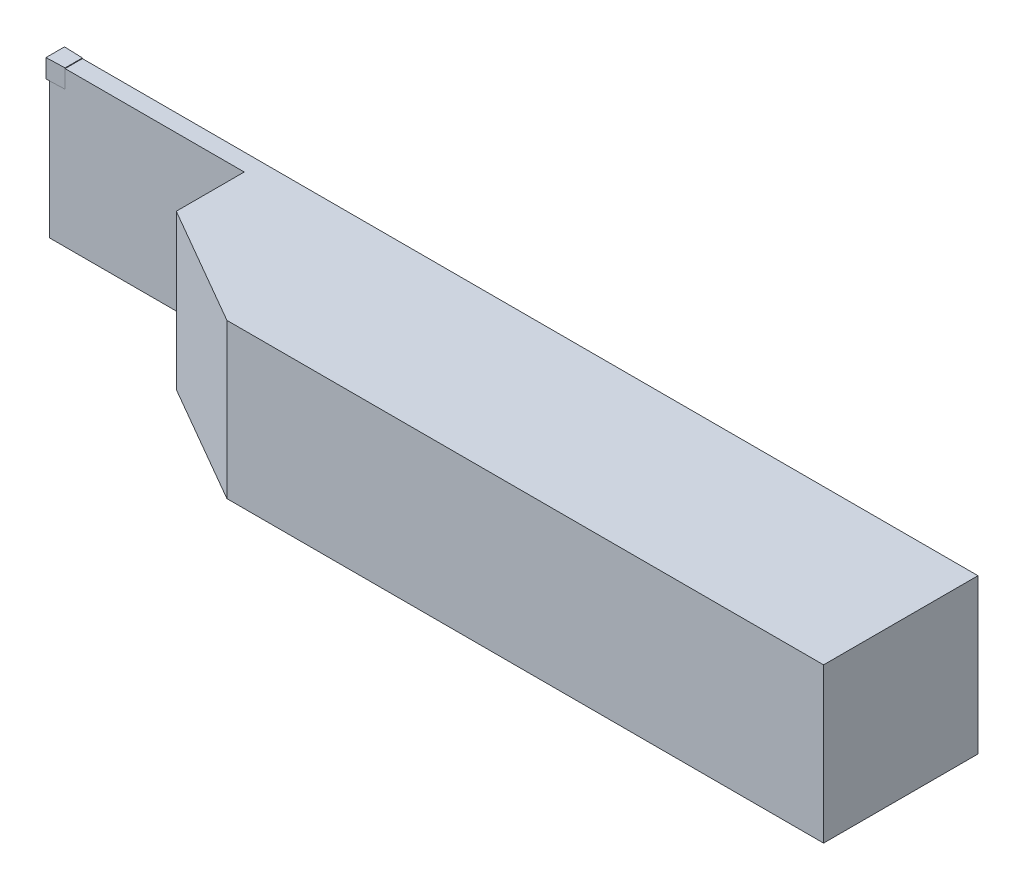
ISO-10303-21;
HEADER;
FILE_DESCRIPTION(('STEP AP214'),'2;1');
FILE_NAME('part.step','',(''),(''),'','','');
FILE_SCHEMA(('AUTOMOTIVE_DESIGN { 1 0 10303 214 1 1 1 1 }'));
ENDSEC;
DATA;
#1=APPLICATION_CONTEXT('core data for automotive mechanical design processes');
#2=APPLICATION_PROTOCOL_DEFINITION('international standard','automotive_design',2000,#1);
#3=PRODUCT_CONTEXT('',#1,'mechanical');
#4=PRODUCT('Part','Part','',(#3));
#5=PRODUCT_RELATED_PRODUCT_CATEGORY('part','',(#4));
#6=PRODUCT_DEFINITION_FORMATION('','',#4);
#7=PRODUCT_DEFINITION_CONTEXT('part definition',#1,'design');
#8=PRODUCT_DEFINITION('design','',#6,#7);
#9=PRODUCT_DEFINITION_SHAPE('','',#8);
#10=(LENGTH_UNIT() NAMED_UNIT(*) SI_UNIT(.MILLI.,.METRE.));
#11=(NAMED_UNIT(*) PLANE_ANGLE_UNIT() SI_UNIT($,.RADIAN.));
#12=(NAMED_UNIT(*) SI_UNIT($,.STERADIAN.) SOLID_ANGLE_UNIT());
#13=UNCERTAINTY_MEASURE_WITH_UNIT(LENGTH_MEASURE(1.E-05),#10,'distance_accuracy_value','');
#14=(GEOMETRIC_REPRESENTATION_CONTEXT(3) GLOBAL_UNCERTAINTY_ASSIGNED_CONTEXT((#13)) GLOBAL_UNIT_ASSIGNED_CONTEXT((#10,
#11,#12)) REPRESENTATION_CONTEXT('',''));
#15=CARTESIAN_POINT('',(0.,0.,0.));
#16=DIRECTION('',(0.,0.,1.));
#17=DIRECTION('',(1.,0.,0.));
#18=AXIS2_PLACEMENT_3D('',#15,#16,#17);
#19=CARTESIAN_POINT('',(0.00999999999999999,-3.,0.0103388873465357));
#20=DIRECTION('',(0.,1.,0.));
#21=DIRECTION('',(0.,0.,1.));
#22=AXIS2_PLACEMENT_3D('',#19,#20,#21);
#23=CYLINDRICAL_SURFACE('',#22,0.01);
#24=CARTESIAN_POINT('',(0.00999999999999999,0.,0.0103388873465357));
#25=DIRECTION('',(0.,1.,0.));
#26=DIRECTION('',(0.,0.,1.));
#27=AXIS2_PLACEMENT_3D('',#24,#25,#26);
#28=CIRCLE('',#27,0.01);
#29=CARTESIAN_POINT('',(0.0103331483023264,0.,0.000344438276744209));
#30=VERTEX_POINT('',#29);
#31=CARTESIAN_POINT('',(0.,0.,0.0103388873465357));
#32=VERTEX_POINT('',#31);
#33=EDGE_CURVE('E139',#30,#32,#28,.T.);
#34=ORIENTED_EDGE('',*,*,#33,.F.);
#35=DIRECTION('',(0.,1.,0.));
#36=VECTOR('',#35,1.);
#37=CARTESIAN_POINT('',(0.0103331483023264,-3.,0.000344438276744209));
#38=LINE('',#37,#36);
#39=CARTESIAN_POINT('',(0.0103331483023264,-3.,0.000344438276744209));
#40=VERTEX_POINT('',#39);
#41=EDGE_CURVE('E53',#40,#30,#38,.T.);
#42=ORIENTED_EDGE('',*,*,#41,.F.);
#43=CARTESIAN_POINT('',(0.00999999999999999,-3.,0.0103388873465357));
#44=DIRECTION('',(0.,1.,0.));
#45=DIRECTION('',(0.,0.,1.));
#46=AXIS2_PLACEMENT_3D('',#43,#44,#45);
#47=CIRCLE('',#46,0.01);
#48=CARTESIAN_POINT('',(0.,-3.,0.0103388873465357));
#49=VERTEX_POINT('',#48);
#50=EDGE_CURVE('E161',#40,#49,#47,.T.);
#51=ORIENTED_EDGE('',*,*,#50,.T.);
#52=DIRECTION('',(0.,1.,0.));
#53=VECTOR('',#52,1.);
#54=CARTESIAN_POINT('',(0.,-3.,0.0103388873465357));
#55=LINE('',#54,#53);
#56=EDGE_CURVE('E92',#49,#32,#55,.T.);
#57=ORIENTED_EDGE('',*,*,#56,.T.);
#58=EDGE_LOOP('',(#34,#42,#51,#57));
#59=FACE_BOUND('',#58,.T.);
#60=ADVANCED_FACE('F30',(#59),#23,.T.);
#61=CARTESIAN_POINT('',(0.0103331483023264,-3.,0.000344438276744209));
#62=DIRECTION('',(0.0333148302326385,0.,-0.999444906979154));
#63=DIRECTION('',(-0.999444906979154,0.,-0.0333148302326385));
#64=AXIS2_PLACEMENT_3D('',#61,#62,#63);
#65=PLANE('',#64);
#66=DIRECTION('',(-0.999444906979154,0.,-0.0333148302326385));
#67=VECTOR('',#66,1.);
#68=CARTESIAN_POINT('',(0.0103331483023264,0.,0.000344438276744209));
#69=LINE('',#68,#67);
#70=CARTESIAN_POINT('',(2.99033314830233,0.,0.0996777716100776));
#71=VERTEX_POINT('',#70);
#72=EDGE_CURVE('E158',#71,#30,#69,.T.);
#73=ORIENTED_EDGE('',*,*,#72,.F.);
#74=DIRECTION('',(0.,1.,0.));
#75=VECTOR('',#74,1.);
#76=CARTESIAN_POINT('',(2.99033314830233,-3.,0.0996777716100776));
#77=LINE('',#76,#75);
#78=CARTESIAN_POINT('',(2.99033314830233,-3.,0.0996777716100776));
#79=VERTEX_POINT('',#78);
#80=EDGE_CURVE('E163',#79,#71,#77,.T.);
#81=ORIENTED_EDGE('',*,*,#80,.F.);
#82=DIRECTION('',(-0.999444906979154,0.,-0.0333148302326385));
#83=VECTOR('',#82,1.);
#84=CARTESIAN_POINT('',(0.0103331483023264,-3.,0.000344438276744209));
#85=LINE('',#84,#83);
#86=EDGE_CURVE('E137',#79,#40,#85,.T.);
#87=ORIENTED_EDGE('',*,*,#86,.T.);
#88=ORIENTED_EDGE('',*,*,#41,.T.);
#89=EDGE_LOOP('',(#73,#81,#87,#88));
#90=FACE_BOUND('',#89,.T.);
#91=ADVANCED_FACE('F215',(#90),#65,.T.);
#92=CARTESIAN_POINT('',(2.99,-3.,0.109672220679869));
#93=DIRECTION('',(0.,1.,0.));
#94=DIRECTION('',(0.,0.,1.));
#95=AXIS2_PLACEMENT_3D('',#92,#93,#94);
#96=CYLINDRICAL_SURFACE('',#95,0.0100000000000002);
#97=DIRECTION('',(0.,1.,0.));
#98=VECTOR('',#97,1.);
#99=CARTESIAN_POINT('',(2.99253932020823,-3.,0.0999999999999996));
#100=LINE('',#99,#98);
#101=CARTESIAN_POINT('',(2.99253932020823,-3.,0.0999999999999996));
#102=VERTEX_POINT('',#101);
#103=CARTESIAN_POINT('',(2.99253932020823,-0.1,0.0999999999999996));
#104=VERTEX_POINT('',#103);
#105=EDGE_CURVE('E189',#102,#104,#100,.T.);
#106=ORIENTED_EDGE('',*,*,#105,.F.);
#107=CARTESIAN_POINT('',(2.99,-3.,0.109672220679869));
#108=DIRECTION('',(0.,1.,0.));
#109=DIRECTION('',(0.,0.,-1.));
#110=AXIS2_PLACEMENT_3D('',#107,#108,#109);
#111=CIRCLE('',#110,0.0100000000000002);
#112=EDGE_CURVE('E127',#102,#79,#111,.T.);
#113=ORIENTED_EDGE('',*,*,#112,.T.);
#114=ORIENTED_EDGE('',*,*,#80,.T.);
#115=CARTESIAN_POINT('',(2.99,0.,0.109672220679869));
#116=DIRECTION('',(0.,1.,0.));
#117=DIRECTION('',(0.,0.,-1.));
#118=AXIS2_PLACEMENT_3D('',#115,#116,#117);
#119=CIRCLE('',#118,0.0100000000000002);
#120=CARTESIAN_POINT('',(3.,0.,0.109672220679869));
#121=VERTEX_POINT('',#120);
#122=EDGE_CURVE('E155',#121,#71,#119,.T.);
#123=ORIENTED_EDGE('',*,*,#122,.F.);
#124=DIRECTION('',(0.,1.,0.));
#125=VECTOR('',#124,1.);
#126=CARTESIAN_POINT('',(3.,-3.,0.109672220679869));
#127=LINE('',#126,#125);
#128=CARTESIAN_POINT('',(3.,-0.0999999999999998,0.109672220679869));
#129=VERTEX_POINT('',#128);
#130=EDGE_CURVE('E165',#129,#121,#127,.T.);
#131=ORIENTED_EDGE('',*,*,#130,.F.);
#132=CARTESIAN_POINT('',(2.99,-0.1,0.109672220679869));
#133=DIRECTION('',(0.,1.,0.));
#134=DIRECTION('',(0.,0.,1.));
#135=AXIS2_PLACEMENT_3D('',#132,#133,#134);
#136=CIRCLE('',#135,0.0100000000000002);
#137=EDGE_CURVE('E143',#104,#129,#136,.F.);
#138=ORIENTED_EDGE('',*,*,#137,.F.);
#139=EDGE_LOOP('',(#106,#113,#114,#123,#131,#138));
#140=FACE_BOUND('',#139,.T.);
#141=ADVANCED_FACE('F198',(#140),#96,.T.);
#142=CARTESIAN_POINT('',(3.,-3.,0.109672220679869));
#143=DIRECTION('',(1.,0.,0.));
#144=DIRECTION('',(0.,0.,-1.));
#145=AXIS2_PLACEMENT_3D('',#142,#143,#144);
#146=PLANE('',#145);
#147=DIRECTION('',(0.,0.,1.));
#148=VECTOR('',#147,1.);
#149=CARTESIAN_POINT('',(3.,-0.0999999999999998,0.109672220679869));
#150=LINE('',#149,#148);
#151=CARTESIAN_POINT('',(3.,-0.1,2.89032777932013));
#152=VERTEX_POINT('',#151);
#153=EDGE_CURVE('E202',#129,#152,#150,.T.);
#154=ORIENTED_EDGE('',*,*,#153,.F.);
#155=ORIENTED_EDGE('',*,*,#130,.T.);
#156=DIRECTION('',(0.,0.,-1.));
#157=VECTOR('',#156,1.);
#158=CARTESIAN_POINT('',(3.,0.,0.109672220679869));
#159=LINE('',#158,#157);
#160=CARTESIAN_POINT('',(3.,0.,2.89032777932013));
#161=VERTEX_POINT('',#160);
#162=EDGE_CURVE('E152',#161,#121,#159,.T.);
#163=ORIENTED_EDGE('',*,*,#162,.F.);
#164=DIRECTION('',(0.,1.,0.));
#165=VECTOR('',#164,1.);
#166=CARTESIAN_POINT('',(3.,-3.,2.89032777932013));
#167=LINE('',#166,#165);
#168=EDGE_CURVE('E115',#152,#161,#167,.T.);
#169=ORIENTED_EDGE('',*,*,#168,.F.);
#170=EDGE_LOOP('',(#154,#155,#163,#169));
#171=FACE_BOUND('',#170,.T.);
#172=ADVANCED_FACE('F220',(#171),#146,.T.);
#173=CARTESIAN_POINT('',(2.99,-3.,2.89032777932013));
#174=DIRECTION('',(0.,1.,0.));
#175=DIRECTION('',(0.,0.,1.));
#176=AXIS2_PLACEMENT_3D('',#173,#174,#175);
#177=CYLINDRICAL_SURFACE('',#176,0.00999999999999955);
#178=DIRECTION('',(0.,1.,0.));
#179=VECTOR('',#178,1.);
#180=CARTESIAN_POINT('',(2.99253932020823,-3.,2.9));
#181=LINE('',#180,#179);
#182=CARTESIAN_POINT('',(2.99253932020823,-0.1,2.9));
#183=VERTEX_POINT('',#182);
#184=CARTESIAN_POINT('',(2.99253932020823,-3.,2.9));
#185=VERTEX_POINT('',#184);
#186=EDGE_CURVE('E44',#183,#185,#181,.F.);
#187=ORIENTED_EDGE('',*,*,#186,.F.);
#188=CARTESIAN_POINT('',(2.99,-0.1,2.89032777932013));
#189=DIRECTION('',(0.,1.,0.));
#190=DIRECTION('',(0.,0.,1.));
#191=AXIS2_PLACEMENT_3D('',#188,#189,#190);
#192=CIRCLE('',#191,0.00999999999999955);
#193=EDGE_CURVE('E11',#152,#183,#192,.F.);
#194=ORIENTED_EDGE('',*,*,#193,.F.);
#195=ORIENTED_EDGE('',*,*,#168,.T.);
#196=CARTESIAN_POINT('',(2.99,0.,2.89032777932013));
#197=DIRECTION('',(0.,1.,0.));
#198=DIRECTION('',(0.,0.,-1.));
#199=AXIS2_PLACEMENT_3D('',#196,#197,#198);
#200=CIRCLE('',#199,0.00999999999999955);
#201=CARTESIAN_POINT('',(2.99033314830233,0.,2.90032222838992));
#202=VERTEX_POINT('',#201);
#203=EDGE_CURVE('E110',#202,#161,#200,.T.);
#204=ORIENTED_EDGE('',*,*,#203,.F.);
#205=DIRECTION('',(0.,1.,0.));
#206=VECTOR('',#205,1.);
#207=CARTESIAN_POINT('',(2.99033314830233,-3.,2.90032222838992));
#208=LINE('',#207,#206);
#209=CARTESIAN_POINT('',(2.99033314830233,-3.,2.90032222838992));
#210=VERTEX_POINT('',#209);
#211=EDGE_CURVE('E105',#210,#202,#208,.T.);
#212=ORIENTED_EDGE('',*,*,#211,.F.);
#213=CARTESIAN_POINT('',(2.99,-3.,2.89032777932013));
#214=DIRECTION('',(0.,1.,0.));
#215=DIRECTION('',(0.,0.,-1.));
#216=AXIS2_PLACEMENT_3D('',#213,#214,#215);
#217=CIRCLE('',#216,0.00999999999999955);
#218=EDGE_CURVE('E108',#210,#185,#217,.T.);
#219=ORIENTED_EDGE('',*,*,#218,.T.);
#220=EDGE_LOOP('',(#187,#194,#195,#204,#212,#219));
#221=FACE_BOUND('',#220,.T.);
#222=ADVANCED_FACE('F107',(#221),#177,.T.);
#223=CARTESIAN_POINT('',(2.99033314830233,-3.,2.90032222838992));
#224=DIRECTION('',(0.0333148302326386,0.,0.999444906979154));
#225=DIRECTION('',(0.999444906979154,0.,-0.0333148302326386));
#226=AXIS2_PLACEMENT_3D('',#223,#224,#225);
#227=PLANE('',#226);
#228=DIRECTION('',(0.999444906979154,0.,-0.0333148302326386));
#229=VECTOR('',#228,1.);
#230=CARTESIAN_POINT('',(2.99033314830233,0.,2.90032222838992));
#231=LINE('',#230,#229);
#232=CARTESIAN_POINT('',(0.0103331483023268,0.,2.99965556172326));
#233=VERTEX_POINT('',#232);
#234=EDGE_CURVE('E149',#233,#202,#231,.T.);
#235=ORIENTED_EDGE('',*,*,#234,.F.);
#236=DIRECTION('',(0.,1.,0.));
#237=VECTOR('',#236,1.);
#238=CARTESIAN_POINT('',(0.0103331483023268,-3.,2.99965556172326));
#239=LINE('',#238,#237);
#240=CARTESIAN_POINT('',(0.0103331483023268,-3.,2.99965556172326));
#241=VERTEX_POINT('',#240);
#242=EDGE_CURVE('E116',#241,#233,#239,.T.);
#243=ORIENTED_EDGE('',*,*,#242,.F.);
#244=DIRECTION('',(0.999444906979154,0.,-0.0333148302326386));
#245=VECTOR('',#244,1.);
#246=CARTESIAN_POINT('',(2.99033314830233,-3.,2.90032222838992));
#247=LINE('',#246,#245);
#248=EDGE_CURVE('E123',#241,#210,#247,.T.);
#249=ORIENTED_EDGE('',*,*,#248,.T.);
#250=ORIENTED_EDGE('',*,*,#211,.T.);
#251=EDGE_LOOP('',(#235,#243,#249,#250));
#252=FACE_BOUND('',#251,.T.);
#253=ADVANCED_FACE('F129',(#252),#227,.T.);
#254=CARTESIAN_POINT('',(0.0100000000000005,-3.,2.98966111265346));
#255=DIRECTION('',(0.,1.,0.));
#256=DIRECTION('',(0.,0.,1.));
#257=AXIS2_PLACEMENT_3D('',#254,#255,#256);
#258=CYLINDRICAL_SURFACE('',#257,0.00999999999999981);
#259=CARTESIAN_POINT('',(0.0100000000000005,0.,2.98966111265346));
#260=DIRECTION('',(0.,1.,0.));
#261=DIRECTION('',(0.,0.,-1.));
#262=AXIS2_PLACEMENT_3D('',#259,#260,#261);
#263=CIRCLE('',#262,0.00999999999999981);
#264=CARTESIAN_POINT('',(0.,0.,2.98966111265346));
#265=VERTEX_POINT('',#264);
#266=EDGE_CURVE('E146',#265,#233,#263,.T.);
#267=ORIENTED_EDGE('',*,*,#266,.F.);
#268=DIRECTION('',(0.,1.,0.));
#269=VECTOR('',#268,1.);
#270=CARTESIAN_POINT('',(0.,-3.,2.98966111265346));
#271=LINE('',#270,#269);
#272=CARTESIAN_POINT('',(0.,-3.,2.98966111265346));
#273=VERTEX_POINT('',#272);
#274=EDGE_CURVE('E169',#273,#265,#271,.T.);
#275=ORIENTED_EDGE('',*,*,#274,.F.);
#276=CARTESIAN_POINT('',(0.0100000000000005,-3.,2.98966111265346));
#277=DIRECTION('',(0.,1.,0.));
#278=DIRECTION('',(0.,0.,-1.));
#279=AXIS2_PLACEMENT_3D('',#276,#277,#278);
#280=CIRCLE('',#279,0.00999999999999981);
#281=EDGE_CURVE('E130',#273,#241,#280,.T.);
#282=ORIENTED_EDGE('',*,*,#281,.T.);
#283=ORIENTED_EDGE('',*,*,#242,.T.);
#284=EDGE_LOOP('',(#267,#275,#282,#283));
#285=FACE_BOUND('',#284,.T.);
#286=ADVANCED_FACE('F363',(#285),#258,.T.);
#287=CARTESIAN_POINT('',(0.,-3.,0.0103388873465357));
#288=DIRECTION('',(-1.,0.,0.));
#289=DIRECTION('',(0.,0.,1.));
#290=AXIS2_PLACEMENT_3D('',#287,#288,#289);
#291=PLANE('',#290);
#292=DIRECTION('',(0.,0.,1.));
#293=VECTOR('',#292,1.);
#294=CARTESIAN_POINT('',(0.,0.,0.0103388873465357));
#295=LINE('',#294,#293);
#296=EDGE_CURVE('E142',#32,#265,#295,.T.);
#297=ORIENTED_EDGE('',*,*,#296,.F.);
#298=ORIENTED_EDGE('',*,*,#56,.F.);
#299=DIRECTION('',(0.,0.,1.));
#300=VECTOR('',#299,1.);
#301=CARTESIAN_POINT('',(0.,-3.,0.0103388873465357));
#302=LINE('',#301,#300);
#303=EDGE_CURVE('E132',#49,#273,#302,.T.);
#304=ORIENTED_EDGE('',*,*,#303,.T.);
#305=ORIENTED_EDGE('',*,*,#274,.T.);
#306=EDGE_LOOP('',(#297,#298,#304,#305));
#307=FACE_BOUND('',#306,.T.);
#308=ADVANCED_FACE('F210',(#307),#291,.T.);
#309=CARTESIAN_POINT('',(0.00999999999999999,-3.,0.0103388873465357));
#310=DIRECTION('',(0.,1.,0.));
#311=DIRECTION('',(0.,0.,1.));
#312=AXIS2_PLACEMENT_3D('',#309,#310,#311);
#313=PLANE('',#312);
#314=ORIENTED_EDGE('',*,*,#112,.F.);
#315=DIRECTION('',(-1.,0.,0.));
#316=VECTOR('',#315,1.);
#317=CARTESIAN_POINT('',(0.01,-3.,0.1));
#318=LINE('',#317,#316);
#319=CARTESIAN_POINT('',(0.5,-3.,0.0999999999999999));
#320=VERTEX_POINT('',#319);
#321=EDGE_CURVE('E37',#102,#320,#318,.T.);
#322=ORIENTED_EDGE('',*,*,#321,.T.);
#323=DIRECTION('',(0.,0.,1.));
#324=VECTOR('',#323,1.);
#325=CARTESIAN_POINT('',(0.5,-3.,0.0103388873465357));
#326=LINE('',#325,#324);
#327=CARTESIAN_POINT('',(0.5,-3.,2.9));
#328=VERTEX_POINT('',#327);
#329=EDGE_CURVE('E173',#320,#328,#326,.T.);
#330=ORIENTED_EDGE('',*,*,#329,.T.);
#331=DIRECTION('',(1.,0.,0.));
#332=VECTOR('',#331,1.);
#333=CARTESIAN_POINT('',(0.0100000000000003,-3.,2.9));
#334=LINE('',#333,#332);
#335=EDGE_CURVE('E126',#328,#185,#334,.T.);
#336=ORIENTED_EDGE('',*,*,#335,.T.);
#337=ORIENTED_EDGE('',*,*,#218,.F.);
#338=ORIENTED_EDGE('',*,*,#248,.F.);
#339=ORIENTED_EDGE('',*,*,#281,.F.);
#340=ORIENTED_EDGE('',*,*,#303,.F.);
#341=ORIENTED_EDGE('',*,*,#50,.F.);
#342=ORIENTED_EDGE('',*,*,#86,.F.);
#343=EDGE_LOOP('',(#314,#322,#330,#336,#337,#338,#339,#340,#341,#342));
#344=FACE_BOUND('',#343,.T.);
#345=ADVANCED_FACE('F121',(#344),#313,.F.);
#346=CARTESIAN_POINT('',(0.00999999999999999,0.,0.0103388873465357));
#347=DIRECTION('',(0.,1.,0.));
#348=DIRECTION('',(0.,0.,1.));
#349=AXIS2_PLACEMENT_3D('',#346,#347,#348);
#350=PLANE('',#349);
#351=ORIENTED_EDGE('',*,*,#33,.T.);
#352=ORIENTED_EDGE('',*,*,#296,.T.);
#353=ORIENTED_EDGE('',*,*,#266,.T.);
#354=ORIENTED_EDGE('',*,*,#234,.T.);
#355=ORIENTED_EDGE('',*,*,#203,.T.);
#356=ORIENTED_EDGE('',*,*,#162,.T.);
#357=ORIENTED_EDGE('',*,*,#122,.T.);
#358=ORIENTED_EDGE('',*,*,#72,.T.);
#359=EDGE_LOOP('',(#351,#352,#353,#354,#355,#356,#357,#358));
#360=FACE_BOUND('',#359,.T.);
#361=ADVANCED_FACE('F213',(#360),#350,.T.);
#362=CARTESIAN_POINT('',(0.5,-25.1,0.0999999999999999));
#363=DIRECTION('',(-1.,0.,0.));
#364=DIRECTION('',(0.,0.,1.));
#365=AXIS2_PLACEMENT_3D('',#362,#363,#364);
#366=PLANE('',#365);
#367=ORIENTED_EDGE('',*,*,#329,.F.);
#368=DIRECTION('',(0.,1.,0.));
#369=VECTOR('',#368,1.);
#370=CARTESIAN_POINT('',(0.5,-25.1,0.0999999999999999));
#371=LINE('',#370,#369);
#372=CARTESIAN_POINT('',(0.5,-25.1,0.0999999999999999));
#373=VERTEX_POINT('',#372);
#374=EDGE_CURVE('E193',#373,#320,#371,.T.);
#375=ORIENTED_EDGE('',*,*,#374,.F.);
#376=DIRECTION('',(0.,0.,1.));
#377=VECTOR('',#376,1.);
#378=CARTESIAN_POINT('',(0.5,-25.1,0.0999999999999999));
#379=LINE('',#378,#377);
#380=CARTESIAN_POINT('',(0.5,-25.1,2.9));
#381=VERTEX_POINT('',#380);
#382=EDGE_CURVE('E279',#373,#381,#379,.T.);
#383=ORIENTED_EDGE('',*,*,#382,.T.);
#384=DIRECTION('',(0.,1.,0.));
#385=VECTOR('',#384,1.);
#386=CARTESIAN_POINT('',(0.5,-25.1,2.9));
#387=LINE('',#386,#385);
#388=EDGE_CURVE('E265',#381,#328,#387,.T.);
#389=ORIENTED_EDGE('',*,*,#388,.T.);
#390=EDGE_LOOP('',(#367,#375,#383,#389));
#391=FACE_BOUND('',#390,.T.);
#392=ADVANCED_FACE('F284',(#391),#366,.T.);
#393=CARTESIAN_POINT('',(0.5,-25.1,0.0999999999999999));
#394=DIRECTION('',(0.,0.,-1.));
#395=DIRECTION('',(-1.,0.,0.));
#396=AXIS2_PLACEMENT_3D('',#393,#394,#395);
#397=PLANE('',#396);
#398=ORIENTED_EDGE('',*,*,#321,.F.);
#399=ORIENTED_EDGE('',*,*,#105,.T.);
#400=DIRECTION('',(-1.,0.,0.));
#401=VECTOR('',#400,1.);
#402=CARTESIAN_POINT('',(0.5,-0.1,0.0999999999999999));
#403=LINE('',#402,#401);
#404=CARTESIAN_POINT('',(148.,-0.1,0.099999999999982));
#405=VERTEX_POINT('',#404);
#406=EDGE_CURVE('E285',#405,#104,#403,.T.);
#407=ORIENTED_EDGE('',*,*,#406,.F.);
#408=DIRECTION('',(0.,1.,0.));
#409=VECTOR('',#408,1.);
#410=CARTESIAN_POINT('',(148.,-25.1,0.099999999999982));
#411=LINE('',#410,#409);
#412=CARTESIAN_POINT('',(148.,-25.1,0.099999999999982));
#413=VERTEX_POINT('',#412);
#414=EDGE_CURVE('E315',#413,#405,#411,.T.);
#415=ORIENTED_EDGE('',*,*,#414,.F.);
#416=DIRECTION('',(-1.,0.,0.));
#417=VECTOR('',#416,1.);
#418=CARTESIAN_POINT('',(0.5,-25.1,0.0999999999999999));
#419=LINE('',#418,#417);
#420=EDGE_CURVE('E273',#413,#373,#419,.T.);
#421=ORIENTED_EDGE('',*,*,#420,.T.);
#422=ORIENTED_EDGE('',*,*,#374,.T.);
#423=EDGE_LOOP('',(#398,#399,#407,#415,#421,#422));
#424=FACE_BOUND('',#423,.T.);
#425=ADVANCED_FACE('F187',(#424),#397,.T.);
#426=CARTESIAN_POINT('',(148.,-25.1,25.1));
#427=DIRECTION('',(1.,0.,0.));
#428=DIRECTION('',(0.,0.,-1.));
#429=AXIS2_PLACEMENT_3D('',#426,#427,#428);
#430=PLANE('',#429);
#431=DIRECTION('',(0.,0.,-1.));
#432=VECTOR('',#431,1.);
#433=CARTESIAN_POINT('',(148.,-0.1,25.1));
#434=LINE('',#433,#432);
#435=CARTESIAN_POINT('',(148.,-0.1,25.1));
#436=VERTEX_POINT('',#435);
#437=EDGE_CURVE('E287',#436,#405,#434,.T.);
#438=ORIENTED_EDGE('',*,*,#437,.F.);
#439=DIRECTION('',(0.,1.,0.));
#440=VECTOR('',#439,1.);
#441=CARTESIAN_POINT('',(148.,-25.1,25.1));
#442=LINE('',#441,#440);
#443=CARTESIAN_POINT('',(148.,-25.1,25.1));
#444=VERTEX_POINT('',#443);
#445=EDGE_CURVE('E317',#444,#436,#442,.T.);
#446=ORIENTED_EDGE('',*,*,#445,.F.);
#447=DIRECTION('',(0.,0.,-1.));
#448=VECTOR('',#447,1.);
#449=CARTESIAN_POINT('',(148.,-25.1,25.1));
#450=LINE('',#449,#448);
#451=EDGE_CURVE('E297',#444,#413,#450,.T.);
#452=ORIENTED_EDGE('',*,*,#451,.T.);
#453=ORIENTED_EDGE('',*,*,#414,.T.);
#454=EDGE_LOOP('',(#438,#446,#452,#453));
#455=FACE_BOUND('',#454,.T.);
#456=ADVANCED_FACE('F336',(#455),#430,.T.);
#457=CARTESIAN_POINT('',(51.3989690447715,-25.1,25.1));
#458=DIRECTION('',(0.,0.,1.));
#459=DIRECTION('',(1.,0.,0.));
#460=AXIS2_PLACEMENT_3D('',#457,#458,#459);
#461=PLANE('',#460);
#462=DIRECTION('',(1.,0.,0.));
#463=VECTOR('',#462,1.);
#464=CARTESIAN_POINT('',(51.3989690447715,-0.1,25.1));
#465=LINE('',#464,#463);
#466=CARTESIAN_POINT('',(51.3989690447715,-0.1,25.1));
#467=VERTEX_POINT('',#466);
#468=EDGE_CURVE('E309',#467,#436,#465,.T.);
#469=ORIENTED_EDGE('',*,*,#468,.F.);
#470=DIRECTION('',(0.,1.,0.));
#471=VECTOR('',#470,1.);
#472=CARTESIAN_POINT('',(51.3989690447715,-25.1,25.1));
#473=LINE('',#472,#471);
#474=CARTESIAN_POINT('',(51.3989690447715,-25.1,25.1));
#475=VERTEX_POINT('',#474);
#476=EDGE_CURVE('E319',#475,#467,#473,.T.);
#477=ORIENTED_EDGE('',*,*,#476,.F.);
#478=DIRECTION('',(1.,0.,0.));
#479=VECTOR('',#478,1.);
#480=CARTESIAN_POINT('',(51.3989690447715,-25.1,25.1));
#481=LINE('',#480,#479);
#482=EDGE_CURVE('E294',#475,#444,#481,.T.);
#483=ORIENTED_EDGE('',*,*,#482,.T.);
#484=ORIENTED_EDGE('',*,*,#445,.T.);
#485=EDGE_LOOP('',(#469,#477,#483,#484));
#486=FACE_BOUND('',#485,.T.);
#487=ADVANCED_FACE('F332',(#486),#461,.T.);
#488=CARTESIAN_POINT('',(32.,-25.1,13.9));
#489=DIRECTION('',(-0.499999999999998,0.,0.86602540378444));
#490=DIRECTION('',(0.86602540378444,0.,0.499999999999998));
#491=AXIS2_PLACEMENT_3D('',#488,#489,#490);
#492=PLANE('',#491);
#493=DIRECTION('',(0.86602540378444,0.,0.499999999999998));
#494=VECTOR('',#493,1.);
#495=CARTESIAN_POINT('',(32.,-0.1,13.9));
#496=LINE('',#495,#494);
#497=CARTESIAN_POINT('',(32.,-0.1,13.9));
#498=VERTEX_POINT('',#497);
#499=EDGE_CURVE('E306',#498,#467,#496,.T.);
#500=ORIENTED_EDGE('',*,*,#499,.F.);
#501=DIRECTION('',(0.,1.,0.));
#502=VECTOR('',#501,1.);
#503=CARTESIAN_POINT('',(32.,-25.1,13.9));
#504=LINE('',#503,#502);
#505=CARTESIAN_POINT('',(32.,-25.1,13.9));
#506=VERTEX_POINT('',#505);
#507=EDGE_CURVE('E321',#506,#498,#504,.T.);
#508=ORIENTED_EDGE('',*,*,#507,.F.);
#509=DIRECTION('',(0.86602540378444,0.,0.499999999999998));
#510=VECTOR('',#509,1.);
#511=CARTESIAN_POINT('',(32.,-25.1,13.9));
#512=LINE('',#511,#510);
#513=EDGE_CURVE('E291',#506,#475,#512,.T.);
#514=ORIENTED_EDGE('',*,*,#513,.T.);
#515=ORIENTED_EDGE('',*,*,#476,.T.);
#516=EDGE_LOOP('',(#500,#508,#514,#515));
#517=FACE_BOUND('',#516,.T.);
#518=ADVANCED_FACE('F329',(#517),#492,.T.);
#519=CARTESIAN_POINT('',(32.,-25.1,2.9));
#520=DIRECTION('',(-1.,0.,0.));
#521=DIRECTION('',(0.,0.,1.));
#522=AXIS2_PLACEMENT_3D('',#519,#520,#521);
#523=PLANE('',#522);
#524=DIRECTION('',(0.,0.,1.));
#525=VECTOR('',#524,1.);
#526=CARTESIAN_POINT('',(32.,-0.1,2.9));
#527=LINE('',#526,#525);
#528=CARTESIAN_POINT('',(32.,-0.1,2.9));
#529=VERTEX_POINT('',#528);
#530=EDGE_CURVE('E303',#529,#498,#527,.T.);
#531=ORIENTED_EDGE('',*,*,#530,.F.);
#532=DIRECTION('',(0.,1.,0.));
#533=VECTOR('',#532,1.);
#534=CARTESIAN_POINT('',(32.,-25.1,2.9));
#535=LINE('',#534,#533);
#536=CARTESIAN_POINT('',(32.,-25.1,2.9));
#537=VERTEX_POINT('',#536);
#538=EDGE_CURVE('E272',#537,#529,#535,.T.);
#539=ORIENTED_EDGE('',*,*,#538,.F.);
#540=DIRECTION('',(0.,0.,1.));
#541=VECTOR('',#540,1.);
#542=CARTESIAN_POINT('',(32.,-25.1,2.9));
#543=LINE('',#542,#541);
#544=EDGE_CURVE('E282',#537,#506,#543,.T.);
#545=ORIENTED_EDGE('',*,*,#544,.T.);
#546=ORIENTED_EDGE('',*,*,#507,.T.);
#547=EDGE_LOOP('',(#531,#539,#545,#546));
#548=FACE_BOUND('',#547,.T.);
#549=ADVANCED_FACE('F325',(#548),#523,.T.);
#550=CARTESIAN_POINT('',(0.5,-25.1,2.9));
#551=DIRECTION('',(0.,0.,1.));
#552=DIRECTION('',(1.,0.,0.));
#553=AXIS2_PLACEMENT_3D('',#550,#551,#552);
#554=PLANE('',#553);
#555=DIRECTION('',(1.,0.,0.));
#556=VECTOR('',#555,1.);
#557=CARTESIAN_POINT('',(0.5,-0.1,2.9));
#558=LINE('',#557,#556);
#559=EDGE_CURVE('E301',#183,#529,#558,.T.);
#560=ORIENTED_EDGE('',*,*,#559,.F.);
#561=ORIENTED_EDGE('',*,*,#186,.T.);
#562=ORIENTED_EDGE('',*,*,#335,.F.);
#563=ORIENTED_EDGE('',*,*,#388,.F.);
#564=DIRECTION('',(1.,0.,0.));
#565=VECTOR('',#564,1.);
#566=CARTESIAN_POINT('',(0.5,-25.1,2.9));
#567=LINE('',#566,#565);
#568=EDGE_CURVE('E269',#381,#537,#567,.T.);
#569=ORIENTED_EDGE('',*,*,#568,.T.);
#570=ORIENTED_EDGE('',*,*,#538,.T.);
#571=EDGE_LOOP('',(#560,#561,#562,#563,#569,#570));
#572=FACE_BOUND('',#571,.T.);
#573=ADVANCED_FACE('F267',(#572),#554,.T.);
#574=CARTESIAN_POINT('',(0.5,-25.1,25.1));
#575=DIRECTION('',(0.,1.,0.));
#576=DIRECTION('',(0.,0.,1.));
#577=AXIS2_PLACEMENT_3D('',#574,#575,#576);
#578=PLANE('',#577);
#579=ORIENTED_EDGE('',*,*,#382,.F.);
#580=ORIENTED_EDGE('',*,*,#420,.F.);
#581=ORIENTED_EDGE('',*,*,#451,.F.);
#582=ORIENTED_EDGE('',*,*,#482,.F.);
#583=ORIENTED_EDGE('',*,*,#513,.F.);
#584=ORIENTED_EDGE('',*,*,#544,.F.);
#585=ORIENTED_EDGE('',*,*,#568,.F.);
#586=EDGE_LOOP('',(#579,#580,#581,#582,#583,#584,#585));
#587=FACE_BOUND('',#586,.T.);
#588=ADVANCED_FACE('F277',(#587),#578,.F.);
#589=CARTESIAN_POINT('',(0.5,-0.1,25.1));
#590=DIRECTION('',(0.,1.,0.));
#591=DIRECTION('',(0.,0.,1.));
#592=AXIS2_PLACEMENT_3D('',#589,#590,#591);
#593=PLANE('',#592);
#594=ORIENTED_EDGE('',*,*,#406,.T.);
#595=ORIENTED_EDGE('',*,*,#137,.T.);
#596=ORIENTED_EDGE('',*,*,#153,.T.);
#597=ORIENTED_EDGE('',*,*,#193,.T.);
#598=ORIENTED_EDGE('',*,*,#559,.T.);
#599=ORIENTED_EDGE('',*,*,#530,.T.);
#600=ORIENTED_EDGE('',*,*,#499,.T.);
#601=ORIENTED_EDGE('',*,*,#468,.T.);
#602=ORIENTED_EDGE('',*,*,#437,.T.);
#603=EDGE_LOOP('',(#594,#595,#596,#597,#598,#599,#600,#601,#602));
#604=FACE_BOUND('',#603,.T.);
#605=ADVANCED_FACE('F223',(#604),#593,.T.);
#606=CLOSED_SHELL('',(#60,#91,#141,#172,#222,#253,#286,#308,#345,#361,#392,#425,#456,#487,#518,
#549,#573,#588,#605));
#607=MANIFOLD_SOLID_BREP('B2',#606);
#608=ADVANCED_BREP_SHAPE_REPRESENTATION('',(#18,#607),#14);
#609=SHAPE_DEFINITION_REPRESENTATION(#9,#608);
ENDSEC;
END-ISO-10303-21;
